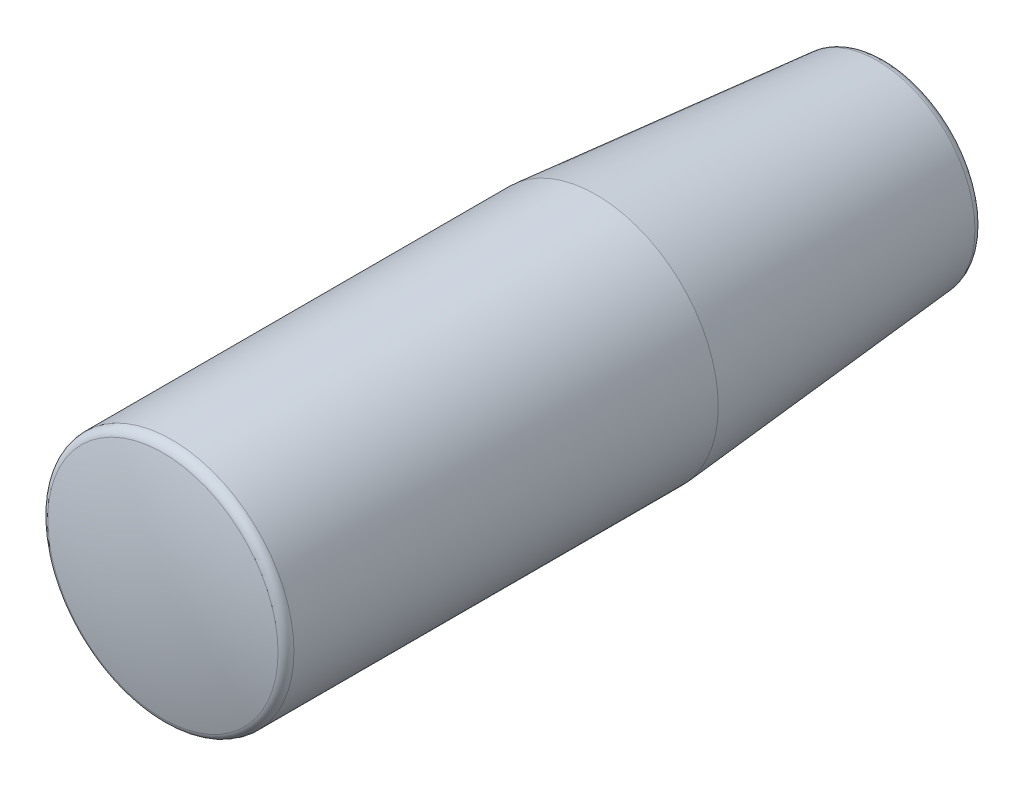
ISO-10303-21;
HEADER;
FILE_DESCRIPTION(('STEP AP214'),'2;1');
FILE_NAME('part.step','',(''),(''),'','','');
FILE_SCHEMA(('AUTOMOTIVE_DESIGN { 1 0 10303 214 1 1 1 1 }'));
ENDSEC;
DATA;
#1=APPLICATION_CONTEXT('core data for automotive mechanical design processes');
#2=APPLICATION_PROTOCOL_DEFINITION('international standard','automotive_design',2000,#1);
#3=PRODUCT_CONTEXT('',#1,'mechanical');
#4=PRODUCT('Part','Part','',(#3));
#5=PRODUCT_RELATED_PRODUCT_CATEGORY('part','',(#4));
#6=PRODUCT_DEFINITION_FORMATION('','',#4);
#7=PRODUCT_DEFINITION_CONTEXT('part definition',#1,'design');
#8=PRODUCT_DEFINITION('design','',#6,#7);
#9=PRODUCT_DEFINITION_SHAPE('','',#8);
#10=(LENGTH_UNIT() NAMED_UNIT(*) SI_UNIT(.MILLI.,.METRE.));
#11=(NAMED_UNIT(*) PLANE_ANGLE_UNIT() SI_UNIT($,.RADIAN.));
#12=(NAMED_UNIT(*) SI_UNIT($,.STERADIAN.) SOLID_ANGLE_UNIT());
#13=UNCERTAINTY_MEASURE_WITH_UNIT(LENGTH_MEASURE(1.E-05),#10,'distance_accuracy_value','');
#14=(GEOMETRIC_REPRESENTATION_CONTEXT(3) GLOBAL_UNCERTAINTY_ASSIGNED_CONTEXT((#13)) GLOBAL_UNIT_ASSIGNED_CONTEXT((#10,
#11,#12)) REPRESENTATION_CONTEXT('',''));
#15=CARTESIAN_POINT('',(0.,0.,0.));
#16=DIRECTION('',(0.,0.,1.));
#17=DIRECTION('',(1.,0.,0.));
#18=AXIS2_PLACEMENT_3D('',#15,#16,#17);
#19=CARTESIAN_POINT('',(0.,0.,0.));
#20=DIRECTION('',(0.,0.,1.));
#21=DIRECTION('',(1.,0.,0.));
#22=AXIS2_PLACEMENT_3D('',#19,#20,#21);
#23=PLANE('',#22);
#24=CARTESIAN_POINT('',(0.,0.,0.));
#25=DIRECTION('',(0.,0.,1.));
#26=DIRECTION('',(1.,0.,0.));
#27=AXIS2_PLACEMENT_3D('',#24,#25,#26);
#28=CIRCLE('',#27,9.58366882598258);
#29=CARTESIAN_POINT('',(9.58366882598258,0.,0.));
#30=VERTEX_POINT('',#29);
#31=EDGE_CURVE('E8',#30,#30,#28,.T.);
#32=ORIENTED_EDGE('',*,*,#31,.F.);
#33=EDGE_LOOP('',(#32));
#34=FACE_BOUND('',#33,.T.);
#35=CARTESIAN_POINT('',(0.,0.,0.));
#36=DIRECTION('',(0.,0.,1.));
#37=DIRECTION('',(1.,0.,0.));
#38=AXIS2_PLACEMENT_3D('',#35,#36,#37);
#39=CIRCLE('',#38,4.4);
#40=CARTESIAN_POINT('',(4.4,0.,0.));
#41=VERTEX_POINT('',#40);
#42=EDGE_CURVE('E34',#41,#41,#39,.T.);
#43=ORIENTED_EDGE('',*,*,#42,.T.);
#44=EDGE_LOOP('',(#43));
#45=FACE_BOUND('',#44,.T.);
#46=ADVANCED_FACE('F12',(#34,#45),#23,.F.);
#47=CARTESIAN_POINT('',(0.,0.,1.));
#48=DIRECTION('',(0.,0.,1.));
#49=DIRECTION('',(1.,0.,0.));
#50=AXIS2_PLACEMENT_3D('',#47,#48,#49);
#51=TOROIDAL_SURFACE('',#50,9.58366882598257,1.);
#52=ORIENTED_EDGE('',*,*,#31,.T.);
#53=EDGE_LOOP('',(#52));
#54=FACE_BOUND('',#53,.T.);
#55=CARTESIAN_POINT('',(0.,0.,0.91284425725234));
#56=DIRECTION('',(0.,0.,1.));
#57=DIRECTION('',(1.,0.,0.));
#58=AXIS2_PLACEMENT_3D('',#55,#56,#57);
#59=CIRCLE('',#58,10.5798635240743);
#60=CARTESIAN_POINT('',(10.5798635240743,0.,0.91284425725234));
#61=VERTEX_POINT('',#60);
#62=EDGE_CURVE('E19',#61,#61,#59,.T.);
#63=ORIENTED_EDGE('',*,*,#62,.F.);
#64=EDGE_LOOP('',(#63));
#65=FACE_BOUND('',#64,.T.);
#66=ADVANCED_FACE('F72',(#54,#65),#51,.T.);
#67=CARTESIAN_POINT('',(0.,0.,0.91284425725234));
#68=DIRECTION('',(0.,0.,1.));
#69=DIRECTION('',(1.,0.,0.));
#70=AXIS2_PLACEMENT_3D('',#67,#68,#69);
#71=CONICAL_SURFACE('',#70,10.5798635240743,0.0872664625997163);
#72=CARTESIAN_POINT('',(0.,0.,31.4326438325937));
#73=DIRECTION('',(0.,0.,1.));
#74=DIRECTION('',(1.,0.,0.));
#75=AXIS2_PLACEMENT_3D('',#72,#73,#74);
#76=CIRCLE('',#75,13.25);
#77=CARTESIAN_POINT('',(13.25,0.,31.4326438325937));
#78=VERTEX_POINT('',#77);
#79=EDGE_CURVE('E23',#78,#78,#76,.T.);
#80=ORIENTED_EDGE('',*,*,#79,.F.);
#81=EDGE_LOOP('',(#80));
#82=FACE_BOUND('',#81,.T.);
#83=ORIENTED_EDGE('',*,*,#62,.T.);
#84=EDGE_LOOP('',(#83));
#85=FACE_BOUND('',#84,.T.);
#86=ADVANCED_FACE('F78',(#82,#85),#71,.T.);
#87=CARTESIAN_POINT('',(0.,0.,80.));
#88=DIRECTION('',(0.,0.,1.));
#89=DIRECTION('',(1.,0.,0.));
#90=AXIS2_PLACEMENT_3D('',#87,#88,#89);
#91=CYLINDRICAL_SURFACE('',#90,13.25);
#92=CARTESIAN_POINT('',(0.,0.,77.4625406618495));
#93=DIRECTION('',(0.,0.,1.));
#94=DIRECTION('',(1.,0.,0.));
#95=AXIS2_PLACEMENT_3D('',#92,#93,#94);
#96=CIRCLE('',#95,13.25);
#97=CARTESIAN_POINT('',(13.25,0.,77.4625406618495));
#98=VERTEX_POINT('',#97);
#99=EDGE_CURVE('E28',#98,#98,#96,.T.);
#100=ORIENTED_EDGE('',*,*,#99,.F.);
#101=EDGE_LOOP('',(#100));
#102=FACE_BOUND('',#101,.T.);
#103=ORIENTED_EDGE('',*,*,#79,.T.);
#104=EDGE_LOOP('',(#103));
#105=FACE_BOUND('',#104,.T.);
#106=ADVANCED_FACE('F101',(#102,#105),#91,.T.);
#107=CARTESIAN_POINT('',(0.,0.,77.4625406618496));
#108=DIRECTION('',(0.,0.,1.));
#109=DIRECTION('',(1.,0.,0.));
#110=AXIS2_PLACEMENT_3D('',#107,#108,#109);
#111=TOROIDAL_SURFACE('',#110,12.25,1.);
#112=ORIENTED_EDGE('',*,*,#99,.T.);
#113=EDGE_LOOP('',(#112));
#114=FACE_BOUND('',#113,.T.);
#115=CARTESIAN_POINT('',(0.,0.,78.4315252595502));
#116=DIRECTION('',(0.,0.,1.));
#117=DIRECTION('',(1.,0.,0.));
#118=AXIS2_PLACEMENT_3D('',#115,#116,#117);
#119=CIRCLE('',#118,12.4971211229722);
#120=CARTESIAN_POINT('',(12.4971211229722,0.,78.4315252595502));
#121=VERTEX_POINT('',#120);
#122=EDGE_CURVE('E31',#121,#121,#119,.T.);
#123=ORIENTED_EDGE('',*,*,#122,.F.);
#124=EDGE_LOOP('',(#123));
#125=FACE_BOUND('',#124,.T.);
#126=ADVANCED_FACE('F94',(#114,#125),#111,.T.);
#127=CARTESIAN_POINT('',(0.,0.,29.4291666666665));
#128=DIRECTION('',(0.,0.,1.));
#129=DIRECTION('',(0.,-1.,0.));
#130=AXIS2_PLACEMENT_3D('',#127,#128,#129);
#131=SPHERICAL_SURFACE('',#130,50.5708333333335);
#132=ORIENTED_EDGE('',*,*,#122,.T.);
#133=EDGE_LOOP('',(#132));
#134=FACE_BOUND('',#133,.T.);
#135=ADVANCED_FACE('F84',(#134),#131,.T.);
#136=CARTESIAN_POINT('',(0.,0.,48.));
#137=DIRECTION('',(0.,0.,1.));
#138=DIRECTION('',(1.,0.,0.));
#139=AXIS2_PLACEMENT_3D('',#136,#137,#138);
#140=CYLINDRICAL_SURFACE('',#139,4.4);
#141=CARTESIAN_POINT('',(0.,0.,7.));
#142=DIRECTION('',(0.,0.,1.));
#143=DIRECTION('',(1.,0.,0.));
#144=AXIS2_PLACEMENT_3D('',#141,#142,#143);
#145=CIRCLE('',#144,4.4);
#146=CARTESIAN_POINT('',(4.4,0.,7.));
#147=VERTEX_POINT('',#146);
#148=EDGE_CURVE('E37',#147,#147,#145,.T.);
#149=ORIENTED_EDGE('',*,*,#148,.T.);
#150=EDGE_LOOP('',(#149));
#151=FACE_BOUND('',#150,.T.);
#152=ORIENTED_EDGE('',*,*,#42,.F.);
#153=EDGE_LOOP('',(#152));
#154=FACE_BOUND('',#153,.T.);
#155=ADVANCED_FACE('F82',(#151,#154),#140,.F.);
#156=CARTESIAN_POINT('',(0.,4.4,7.));
#157=DIRECTION('',(0.,0.,-1.));
#158=DIRECTION('',(-1.,0.,0.));
#159=AXIS2_PLACEMENT_3D('',#156,#157,#158);
#160=PLANE('',#159);
#161=CARTESIAN_POINT('',(0.,0.,7.));
#162=DIRECTION('',(0.,0.,-1.));
#163=DIRECTION('',(-1.,0.,0.));
#164=AXIS2_PLACEMENT_3D('',#161,#162,#163);
#165=CIRCLE('',#164,4.);
#166=CARTESIAN_POINT('',(-4.,0.,7.));
#167=VERTEX_POINT('',#166);
#168=EDGE_CURVE('E43',#167,#167,#165,.T.);
#169=ORIENTED_EDGE('',*,*,#168,.F.);
#170=EDGE_LOOP('',(#169));
#171=FACE_BOUND('',#170,.T.);
#172=ORIENTED_EDGE('',*,*,#148,.F.);
#173=EDGE_LOOP('',(#172));
#174=FACE_BOUND('',#173,.T.);
#175=ADVANCED_FACE('F68',(#171,#174),#160,.T.);
#176=CARTESIAN_POINT('',(0.,0.,40.));
#177=DIRECTION('',(0.,0.,-1.));
#178=DIRECTION('',(-1.,0.,0.));
#179=AXIS2_PLACEMENT_3D('',#176,#177,#178);
#180=CYLINDRICAL_SURFACE('',#179,4.);
#181=ORIENTED_EDGE('',*,*,#168,.T.);
#182=EDGE_LOOP('',(#181));
#183=FACE_BOUND('',#182,.T.);
#184=CARTESIAN_POINT('',(0.,0.,40.));
#185=DIRECTION('',(0.,0.,-1.));
#186=DIRECTION('',(-1.,0.,0.));
#187=AXIS2_PLACEMENT_3D('',#184,#185,#186);
#188=CIRCLE('',#187,4.);
#189=CARTESIAN_POINT('',(-4.,0.,40.));
#190=VERTEX_POINT('',#189);
#191=EDGE_CURVE('E46',#190,#190,#188,.T.);
#192=ORIENTED_EDGE('',*,*,#191,.F.);
#193=EDGE_LOOP('',(#192));
#194=FACE_BOUND('',#193,.T.);
#195=ADVANCED_FACE('F58',(#183,#194),#180,.F.);
#196=CARTESIAN_POINT('',(0.,0.,40.));
#197=DIRECTION('',(0.,0.,-1.));
#198=DIRECTION('',(-1.,0.,0.));
#199=AXIS2_PLACEMENT_3D('',#196,#197,#198);
#200=PLANE('',#199);
#201=CARTESIAN_POINT('',(0.,0.,40.));
#202=DIRECTION('',(0.,0.,-1.));
#203=DIRECTION('',(-1.,0.,0.));
#204=AXIS2_PLACEMENT_3D('',#201,#202,#203);
#205=CIRCLE('',#204,3.3235);
#206=CARTESIAN_POINT('',(-3.3235,0.,40.));
#207=VERTEX_POINT('',#206);
#208=EDGE_CURVE('E15',#207,#207,#205,.T.);
#209=ORIENTED_EDGE('',*,*,#208,.F.);
#210=EDGE_LOOP('',(#209));
#211=FACE_BOUND('',#210,.T.);
#212=ORIENTED_EDGE('',*,*,#191,.T.);
#213=EDGE_LOOP('',(#212));
#214=FACE_BOUND('',#213,.T.);
#215=ADVANCED_FACE('F55',(#211,#214),#200,.T.);
#216=CARTESIAN_POINT('',(0.,3.3235,48.));
#217=DIRECTION('',(0.,0.,-1.));
#218=DIRECTION('',(-1.,0.,0.));
#219=AXIS2_PLACEMENT_3D('',#216,#217,#218);
#220=PLANE('',#219);
#221=CARTESIAN_POINT('',(0.,0.,48.));
#222=DIRECTION('',(0.,0.,1.));
#223=DIRECTION('',(1.,0.,0.));
#224=AXIS2_PLACEMENT_3D('',#221,#222,#223);
#225=CIRCLE('',#224,3.3235);
#226=CARTESIAN_POINT('',(3.3235,0.,48.));
#227=VERTEX_POINT('',#226);
#228=EDGE_CURVE('E40',#227,#227,#225,.T.);
#229=ORIENTED_EDGE('',*,*,#228,.F.);
#230=EDGE_LOOP('',(#229));
#231=FACE_BOUND('',#230,.T.);
#232=ADVANCED_FACE('F57',(#231),#220,.T.);
#233=CARTESIAN_POINT('',(0.,0.,48.));
#234=DIRECTION('',(0.,0.,1.));
#235=DIRECTION('',(1.,0.,0.));
#236=AXIS2_PLACEMENT_3D('',#233,#234,#235);
#237=CYLINDRICAL_SURFACE('',#236,3.3235);
#238=ORIENTED_EDGE('',*,*,#228,.T.);
#239=EDGE_LOOP('',(#238));
#240=FACE_BOUND('',#239,.T.);
#241=ORIENTED_EDGE('',*,*,#208,.T.);
#242=EDGE_LOOP('',(#241));
#243=FACE_BOUND('',#242,.T.);
#244=ADVANCED_FACE('F53',(#240,#243),#237,.F.);
#245=CLOSED_SHELL('',(#46,#66,#86,#106,#126,#135,#155,#175,#195,#215,#232,#244));
#246=MANIFOLD_SOLID_BREP('B1',#245);
#247=ADVANCED_BREP_SHAPE_REPRESENTATION('',(#18,#246),#14);
#248=SHAPE_DEFINITION_REPRESENTATION(#9,#247);
ENDSEC;
END-ISO-10303-21;
